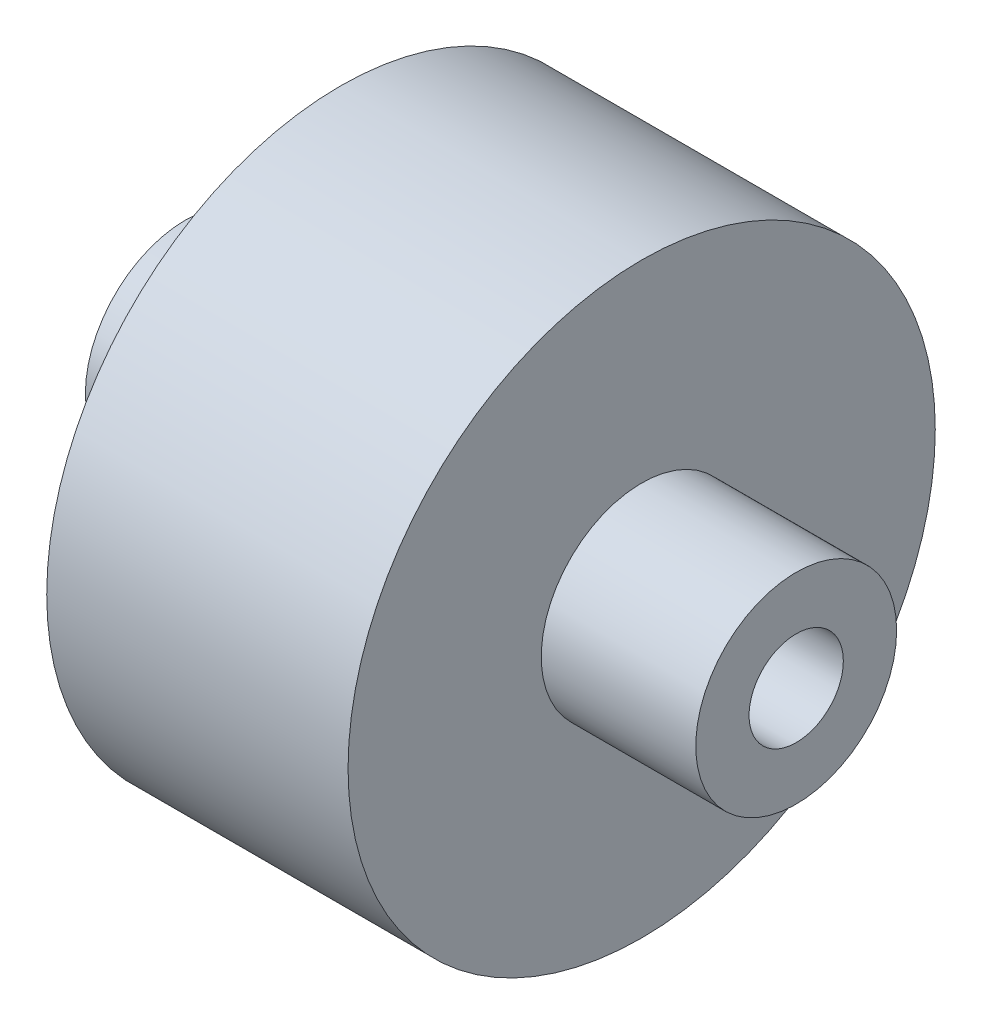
from build123d import *

# Parameters (mm, degrees)
SKETCH1_R               = 19
BOSS_EXTRUDE1_DEPTH     = 19.5
SKETCH2_R               = 6.5
BOSS_EXTRUDE2_DEPTH     = 10
BOSS_EXTRUDE3_START     = 10
SKETCH3_R               = 6.5
BOSS_EXTRUDE3_DEPTH     = 10
CUT_EXTRUDE1_DEPTH      = 48.772900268
CUT_EXTRUDE1_DEPTH_BACK = 48.772900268
SKETCH4_R               = 3.05


with BuildPart() as part:
    # Sketch1 → Boss-Extrude1 (new body)
    with BuildSketch(Plane(origin=(0, 0, 0), x_dir=(0, 0, -1), z_dir=(1, 0, 0))):
        Circle(SKETCH1_R)
    extrude(amount=BOSS_EXTRUDE1_DEPTH)

    # Sketch2 → Boss-Extrude2 (add)
    with BuildSketch(Plane(origin=(19.5, 0, 0), x_dir=(0, 0, -1), z_dir=(1, 0, 0))):
        Circle(SKETCH2_R)
    extrude(amount=BOSS_EXTRUDE2_DEPTH)

    # Sketch3 → Boss-Extrude3 (add)
    with BuildSketch(Plane.ZY.offset(BOSS_EXTRUDE3_START)):
        with Locations(Location((0, 0, 0), (0, 0, 180))):
            Circle(SKETCH3_R)
    extrude(amount=-BOSS_EXTRUDE3_DEPTH)

    # Sketch4 → Cut-Extrude1 (cut, two sides: drawn at the far end of the back side and taken through both)
    with BuildSketch(Plane(origin=(29.5, 0, 0), x_dir=(0, 0, -1), z_dir=(1, 0, 0)).offset(-CUT_EXTRUDE1_DEPTH_BACK)):
        Circle(SKETCH4_R)
    extrude(amount=CUT_EXTRUDE1_DEPTH + CUT_EXTRUDE1_DEPTH_BACK, mode=Mode.SUBTRACT)


solid = part.part
